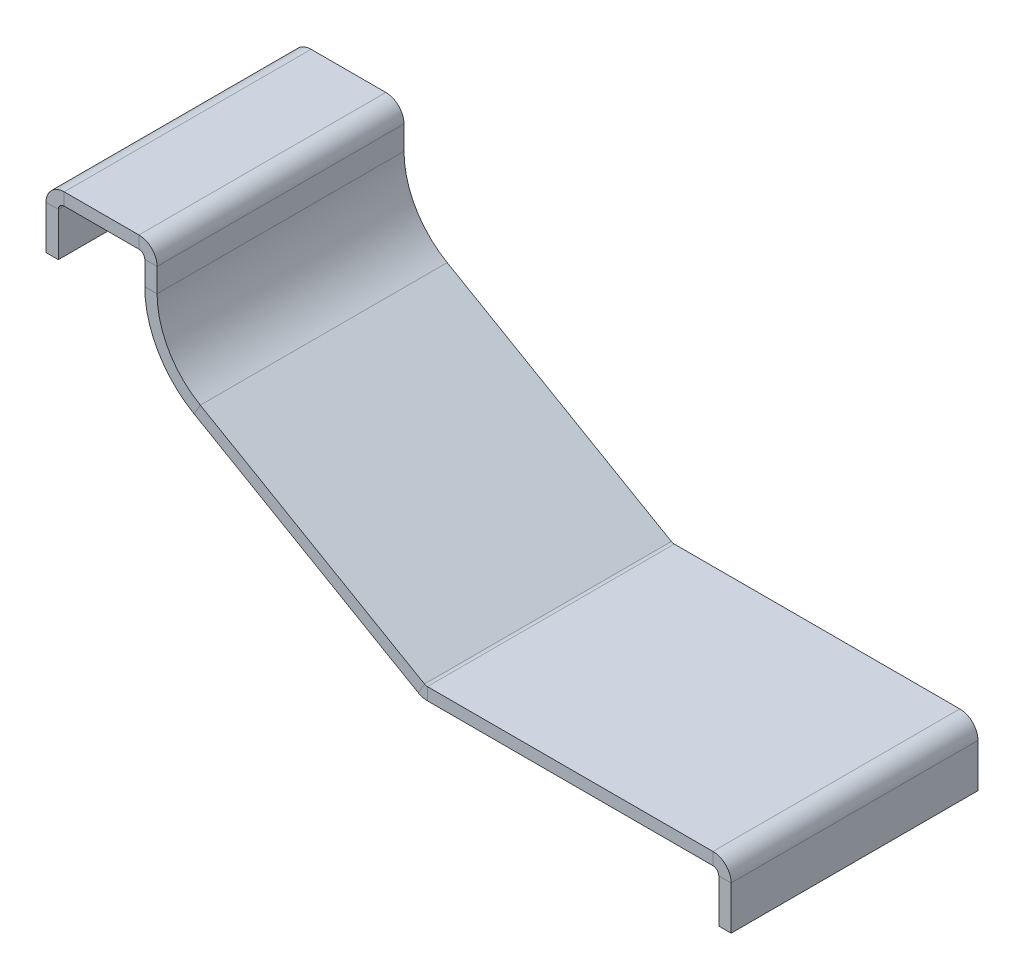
ISO-10303-21;
HEADER;
FILE_DESCRIPTION(('STEP AP214'),'2;1');
FILE_NAME('part.step','',(''),(''),'','','');
FILE_SCHEMA(('AUTOMOTIVE_DESIGN { 1 0 10303 214 1 1 1 1 }'));
ENDSEC;
DATA;
#1=APPLICATION_CONTEXT('core data for automotive mechanical design processes');
#2=APPLICATION_PROTOCOL_DEFINITION('international standard','automotive_design',2000,#1);
#3=PRODUCT_CONTEXT('',#1,'mechanical');
#4=PRODUCT('Part','Part','',(#3));
#5=PRODUCT_RELATED_PRODUCT_CATEGORY('part','',(#4));
#6=PRODUCT_DEFINITION_FORMATION('','',#4);
#7=PRODUCT_DEFINITION_CONTEXT('part definition',#1,'design');
#8=PRODUCT_DEFINITION('design','',#6,#7);
#9=PRODUCT_DEFINITION_SHAPE('','',#8);
#10=(LENGTH_UNIT() NAMED_UNIT(*) SI_UNIT(.MILLI.,.METRE.));
#11=(NAMED_UNIT(*) PLANE_ANGLE_UNIT() SI_UNIT($,.RADIAN.));
#12=(NAMED_UNIT(*) SI_UNIT($,.STERADIAN.) SOLID_ANGLE_UNIT());
#13=UNCERTAINTY_MEASURE_WITH_UNIT(LENGTH_MEASURE(1.E-05),#10,'distance_accuracy_value','');
#14=(GEOMETRIC_REPRESENTATION_CONTEXT(3) GLOBAL_UNCERTAINTY_ASSIGNED_CONTEXT((#13)) GLOBAL_UNIT_ASSIGNED_CONTEXT((#10,
#11,#12)) REPRESENTATION_CONTEXT('',''));
#15=CARTESIAN_POINT('',(0.,0.,0.));
#16=DIRECTION('',(0.,0.,1.));
#17=DIRECTION('',(1.,0.,0.));
#18=AXIS2_PLACEMENT_3D('',#15,#16,#17);
#19=CARTESIAN_POINT('',(6.44142254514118,-12.,5.));
#20=DIRECTION('',(0.,-1.,0.));
#21=DIRECTION('',(1.,0.,0.));
#22=AXIS2_PLACEMENT_3D('',#19,#20,#21);
#23=PLANE('',#22);
#24=DIRECTION('',(1.,0.,0.));
#25=VECTOR('',#24,1.);
#26=CARTESIAN_POINT('',(6.44142254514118,-12.,-5.));
#27=LINE('',#26,#25);
#28=CARTESIAN_POINT('',(26.75,-12.,-5.));
#29=VERTEX_POINT('',#28);
#30=CARTESIAN_POINT('',(27.25,-12.,-5.));
#31=VERTEX_POINT('',#30);
#32=EDGE_CURVE('E250',#29,#31,#27,.T.);
#33=ORIENTED_EDGE('',*,*,#32,.T.);
#34=DIRECTION('',(0.,0.,-1.));
#35=VECTOR('',#34,1.);
#36=CARTESIAN_POINT('',(27.25,-12.,5.));
#37=LINE('',#36,#35);
#38=CARTESIAN_POINT('',(27.25,-12.,5.));
#39=VERTEX_POINT('',#38);
#40=EDGE_CURVE('E241',#39,#31,#37,.T.);
#41=ORIENTED_EDGE('',*,*,#40,.F.);
#42=DIRECTION('',(1.,0.,0.));
#43=VECTOR('',#42,1.);
#44=CARTESIAN_POINT('',(6.44142254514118,-12.,5.));
#45=LINE('',#44,#43);
#46=CARTESIAN_POINT('',(26.75,-12.,5.));
#47=VERTEX_POINT('',#46);
#48=EDGE_CURVE('E239',#47,#39,#45,.T.);
#49=ORIENTED_EDGE('',*,*,#48,.F.);
#50=DIRECTION('',(0.,0.,-1.));
#51=VECTOR('',#50,1.);
#52=CARTESIAN_POINT('',(26.75,-12.,5.));
#53=LINE('',#52,#51);
#54=EDGE_CURVE('E248',#47,#29,#53,.T.);
#55=ORIENTED_EDGE('',*,*,#54,.T.);
#56=EDGE_LOOP('',(#33,#41,#49,#55));
#57=FACE_BOUND('',#56,.T.);
#58=ADVANCED_FACE('F17',(#57),#23,.T.);
#59=CARTESIAN_POINT('',(6.44142254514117,-10.,-5.));
#60=DIRECTION('',(0.,0.,1.));
#61=DIRECTION('',(0.,-1.,0.));
#62=AXIS2_PLACEMENT_3D('',#59,#60,#61);
#63=PLANE('',#62);
#64=DIRECTION('',(0.,1.,0.));
#65=VECTOR('',#64,1.);
#66=CARTESIAN_POINT('',(27.25,-10.,-5.));
#67=LINE('',#66,#65);
#68=CARTESIAN_POINT('',(27.25,-10.2366,-5.));
#69=VERTEX_POINT('',#68);
#70=EDGE_CURVE('E245',#69,#31,#67,.F.);
#71=ORIENTED_EDGE('',*,*,#70,.T.);
#72=ORIENTED_EDGE('',*,*,#32,.F.);
#73=DIRECTION('',(0.,-1.,0.));
#74=VECTOR('',#73,1.);
#75=CARTESIAN_POINT('',(26.75,-10.,-5.));
#76=LINE('',#75,#74);
#77=CARTESIAN_POINT('',(26.75,-10.2366,-5.));
#78=VERTEX_POINT('',#77);
#79=EDGE_CURVE('E11',#78,#29,#76,.T.);
#80=ORIENTED_EDGE('',*,*,#79,.F.);
#81=DIRECTION('',(1.,0.,0.));
#82=VECTOR('',#81,1.);
#83=CARTESIAN_POINT('',(6.44142254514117,-10.2366,-5.));
#84=LINE('',#83,#82);
#85=EDGE_CURVE('E243',#78,#69,#84,.T.);
#86=ORIENTED_EDGE('',*,*,#85,.T.);
#87=EDGE_LOOP('',(#71,#72,#80,#86));
#88=FACE_BOUND('',#87,.T.);
#89=ADVANCED_FACE('F534',(#88),#63,.F.);
#90=CARTESIAN_POINT('',(27.25,-10.,5.));
#91=DIRECTION('',(1.,0.,0.));
#92=DIRECTION('',(0.,0.,-1.));
#93=AXIS2_PLACEMENT_3D('',#90,#91,#92);
#94=PLANE('',#93);
#95=DIRECTION('',(0.,0.,-1.));
#96=VECTOR('',#95,1.);
#97=CARTESIAN_POINT('',(27.25,-10.2366,-5.));
#98=LINE('',#97,#96);
#99=CARTESIAN_POINT('',(27.25,-10.2366,5.));
#100=VERTEX_POINT('',#99);
#101=EDGE_CURVE('E252',#100,#69,#98,.T.);
#102=ORIENTED_EDGE('',*,*,#101,.F.);
#103=DIRECTION('',(0.,1.,0.));
#104=VECTOR('',#103,1.);
#105=CARTESIAN_POINT('',(27.25,-10.,5.));
#106=LINE('',#105,#104);
#107=EDGE_CURVE('E237',#39,#100,#106,.T.);
#108=ORIENTED_EDGE('',*,*,#107,.F.);
#109=ORIENTED_EDGE('',*,*,#40,.T.);
#110=ORIENTED_EDGE('',*,*,#70,.F.);
#111=EDGE_LOOP('',(#102,#108,#109,#110));
#112=FACE_BOUND('',#111,.T.);
#113=ADVANCED_FACE('F540',(#112),#94,.T.);
#114=CARTESIAN_POINT('',(6.44142254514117,-10.,5.));
#115=DIRECTION('',(0.,0.,1.));
#116=DIRECTION('',(0.,-1.,0.));
#117=AXIS2_PLACEMENT_3D('',#114,#115,#116);
#118=PLANE('',#117);
#119=ORIENTED_EDGE('',*,*,#48,.T.);
#120=ORIENTED_EDGE('',*,*,#107,.T.);
#121=DIRECTION('',(1.,0.,0.));
#122=VECTOR('',#121,1.);
#123=CARTESIAN_POINT('',(6.44142254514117,-10.2366,5.));
#124=LINE('',#123,#122);
#125=CARTESIAN_POINT('',(26.75,-10.2366,5.));
#126=VERTEX_POINT('',#125);
#127=EDGE_CURVE('E21',#126,#100,#124,.T.);
#128=ORIENTED_EDGE('',*,*,#127,.F.);
#129=DIRECTION('',(0.,1.,0.));
#130=VECTOR('',#129,1.);
#131=CARTESIAN_POINT('',(26.75,-10.,5.));
#132=LINE('',#131,#130);
#133=EDGE_CURVE('E36',#47,#126,#132,.T.);
#134=ORIENTED_EDGE('',*,*,#133,.F.);
#135=EDGE_LOOP('',(#119,#120,#128,#134));
#136=FACE_BOUND('',#135,.T.);
#137=ADVANCED_FACE('F546',(#136),#118,.T.);
#138=CARTESIAN_POINT('',(26.75,-10.,5.));
#139=DIRECTION('',(1.,0.,0.));
#140=DIRECTION('',(0.,0.,-1.));
#141=AXIS2_PLACEMENT_3D('',#138,#139,#140);
#142=PLANE('',#141);
#143=ORIENTED_EDGE('',*,*,#133,.T.);
#144=DIRECTION('',(0.,0.,-1.));
#145=VECTOR('',#144,1.);
#146=CARTESIAN_POINT('',(26.75,-10.2366,-5.));
#147=LINE('',#146,#145);
#148=EDGE_CURVE('E27',#126,#78,#147,.T.);
#149=ORIENTED_EDGE('',*,*,#148,.T.);
#150=ORIENTED_EDGE('',*,*,#79,.T.);
#151=ORIENTED_EDGE('',*,*,#54,.F.);
#152=EDGE_LOOP('',(#143,#149,#150,#151));
#153=FACE_BOUND('',#152,.T.);
#154=ADVANCED_FACE('F19',(#153),#142,.F.);
#155=CARTESIAN_POINT('',(14.75,20.5792752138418,5.));
#156=DIRECTION('',(0.,0.,-1.));
#157=DIRECTION('',(-1.,0.,0.));
#158=AXIS2_PLACEMENT_3D('',#155,#156,#157);
#159=PLANE('',#158);
#160=DIRECTION('',(0.,-1.,0.));
#161=VECTOR('',#160,1.);
#162=CARTESIAN_POINT('',(14.9473713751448,20.5792752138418,5.));
#163=LINE('',#162,#161);
#164=CARTESIAN_POINT('',(14.9473713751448,-9.5,5.));
#165=VERTEX_POINT('',#164);
#166=CARTESIAN_POINT('',(14.9473713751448,-10.,5.));
#167=VERTEX_POINT('',#166);
#168=EDGE_CURVE('E198',#165,#167,#163,.T.);
#169=ORIENTED_EDGE('',*,*,#168,.T.);
#170=DIRECTION('',(1.,0.,0.));
#171=VECTOR('',#170,1.);
#172=CARTESIAN_POINT('',(14.75,-10.,5.));
#173=LINE('',#172,#171);
#174=CARTESIAN_POINT('',(26.5134,-10.,5.));
#175=VERTEX_POINT('',#174);
#176=EDGE_CURVE('E212',#167,#175,#173,.T.);
#177=ORIENTED_EDGE('',*,*,#176,.T.);
#178=DIRECTION('',(0.,-1.,0.));
#179=VECTOR('',#178,1.);
#180=CARTESIAN_POINT('',(26.5134,20.5792752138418,5.));
#181=LINE('',#180,#179);
#182=CARTESIAN_POINT('',(26.5134,-9.5,5.));
#183=VERTEX_POINT('',#182);
#184=EDGE_CURVE('E187',#183,#175,#181,.T.);
#185=ORIENTED_EDGE('',*,*,#184,.F.);
#186=DIRECTION('',(1.,0.,0.));
#187=VECTOR('',#186,1.);
#188=CARTESIAN_POINT('',(14.75,-9.5,5.));
#189=LINE('',#188,#187);
#190=EDGE_CURVE('E256',#165,#183,#189,.T.);
#191=ORIENTED_EDGE('',*,*,#190,.F.);
#192=EDGE_LOOP('',(#169,#177,#185,#191));
#193=FACE_BOUND('',#192,.T.);
#194=ADVANCED_FACE('F213',(#193),#159,.F.);
#195=CARTESIAN_POINT('',(14.75,-10.,5.));
#196=DIRECTION('',(0.,1.,0.));
#197=DIRECTION('',(0.,0.,1.));
#198=AXIS2_PLACEMENT_3D('',#195,#196,#197);
#199=PLANE('',#198);
#200=DIRECTION('',(1.,0.,0.));
#201=VECTOR('',#200,1.);
#202=CARTESIAN_POINT('',(14.75,-10.,-5.));
#203=LINE('',#202,#201);
#204=CARTESIAN_POINT('',(14.9473713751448,-10.,-5.));
#205=VERTEX_POINT('',#204);
#206=CARTESIAN_POINT('',(26.5134,-10.,-5.));
#207=VERTEX_POINT('',#206);
#208=EDGE_CURVE('E216',#205,#207,#203,.T.);
#209=ORIENTED_EDGE('',*,*,#208,.T.);
#210=DIRECTION('',(0.,0.,1.));
#211=VECTOR('',#210,1.);
#212=CARTESIAN_POINT('',(26.5134,-10.,-5.));
#213=LINE('',#212,#211);
#214=EDGE_CURVE('E206',#207,#175,#213,.T.);
#215=ORIENTED_EDGE('',*,*,#214,.T.);
#216=ORIENTED_EDGE('',*,*,#176,.F.);
#217=DIRECTION('',(0.,0.,-1.));
#218=VECTOR('',#217,1.);
#219=CARTESIAN_POINT('',(14.9473713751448,-10.,5.));
#220=LINE('',#219,#218);
#221=EDGE_CURVE('E221',#167,#205,#220,.T.);
#222=ORIENTED_EDGE('',*,*,#221,.T.);
#223=EDGE_LOOP('',(#209,#215,#216,#222));
#224=FACE_BOUND('',#223,.T.);
#225=ADVANCED_FACE('F218',(#224),#199,.F.);
#226=CARTESIAN_POINT('',(14.75,20.5792752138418,-5.));
#227=DIRECTION('',(0.,0.,-1.));
#228=DIRECTION('',(-1.,0.,0.));
#229=AXIS2_PLACEMENT_3D('',#226,#227,#228);
#230=PLANE('',#229);
#231=ORIENTED_EDGE('',*,*,#208,.F.);
#232=DIRECTION('',(0.,-1.,0.));
#233=VECTOR('',#232,1.);
#234=CARTESIAN_POINT('',(14.9473713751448,20.5792752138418,-5.));
#235=LINE('',#234,#233);
#236=CARTESIAN_POINT('',(14.9473713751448,-9.5,-5.));
#237=VERTEX_POINT('',#236);
#238=EDGE_CURVE('E230',#237,#205,#235,.T.);
#239=ORIENTED_EDGE('',*,*,#238,.F.);
#240=DIRECTION('',(1.,0.,0.));
#241=VECTOR('',#240,1.);
#242=CARTESIAN_POINT('',(14.75,-9.5,-5.));
#243=LINE('',#242,#241);
#244=CARTESIAN_POINT('',(26.5134,-9.5,-5.));
#245=VERTEX_POINT('',#244);
#246=EDGE_CURVE('E223',#237,#245,#243,.T.);
#247=ORIENTED_EDGE('',*,*,#246,.T.);
#248=DIRECTION('',(0.,-1.,0.));
#249=VECTOR('',#248,1.);
#250=CARTESIAN_POINT('',(26.5134,20.5792752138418,-5.));
#251=LINE('',#250,#249);
#252=EDGE_CURVE('E257',#245,#207,#251,.T.);
#253=ORIENTED_EDGE('',*,*,#252,.T.);
#254=EDGE_LOOP('',(#231,#239,#247,#253));
#255=FACE_BOUND('',#254,.T.);
#256=ADVANCED_FACE('F270',(#255),#230,.T.);
#257=CARTESIAN_POINT('',(14.75,-9.5,5.));
#258=DIRECTION('',(0.,1.,0.));
#259=DIRECTION('',(0.,0.,1.));
#260=AXIS2_PLACEMENT_3D('',#257,#258,#259);
#261=PLANE('',#260);
#262=DIRECTION('',(0.,0.,1.));
#263=VECTOR('',#262,1.);
#264=CARTESIAN_POINT('',(26.5134,-9.5,-5.));
#265=LINE('',#264,#263);
#266=EDGE_CURVE('E199',#245,#183,#265,.T.);
#267=ORIENTED_EDGE('',*,*,#266,.F.);
#268=ORIENTED_EDGE('',*,*,#246,.F.);
#269=DIRECTION('',(0.,0.,-1.));
#270=VECTOR('',#269,1.);
#271=CARTESIAN_POINT('',(14.9473713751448,-9.5,5.));
#272=LINE('',#271,#270);
#273=EDGE_CURVE('E232',#165,#237,#272,.T.);
#274=ORIENTED_EDGE('',*,*,#273,.F.);
#275=ORIENTED_EDGE('',*,*,#190,.T.);
#276=EDGE_LOOP('',(#267,#268,#274,#275));
#277=FACE_BOUND('',#276,.T.);
#278=ADVANCED_FACE('F271',(#277),#261,.T.);
#279=CARTESIAN_POINT('',(19.9881347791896,20.4346755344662,5.));
#280=DIRECTION('',(0.,0.,-1.));
#281=DIRECTION('',(-0.866025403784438,0.5,0.));
#282=AXIS2_PLACEMENT_3D('',#279,#280,#281);
#283=PLANE('',#282);
#284=DIRECTION('',(-0.5,-0.866025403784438,0.));
#285=VECTOR('',#284,1.);
#286=CARTESIAN_POINT('',(19.9881347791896,20.4346755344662,5.));
#287=LINE('',#286,#285);
#288=CARTESIAN_POINT('',(5.75,-4.22649730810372,5.));
#289=VERTEX_POINT('',#288);
#290=CARTESIAN_POINT('',(5.5,-4.65951000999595,5.));
#291=VERTEX_POINT('',#290);
#292=EDGE_CURVE('E440',#289,#291,#287,.T.);
#293=ORIENTED_EDGE('',*,*,#292,.T.);
#294=DIRECTION('',(0.866025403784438,-0.5,0.));
#295=VECTOR('',#294,1.);
#296=CARTESIAN_POINT('',(5.5,-4.65951000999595,5.));
#297=LINE('',#296,#295);
#298=CARTESIAN_POINT('',(14.5790713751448,-9.90131431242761,5.));
#299=VERTEX_POINT('',#298);
#300=EDGE_CURVE('E437',#291,#299,#297,.T.);
#301=ORIENTED_EDGE('',*,*,#300,.T.);
#302=DIRECTION('',(-0.5,-0.866025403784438,0.));
#303=VECTOR('',#302,1.);
#304=CARTESIAN_POINT('',(29.0672061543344,15.1928712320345,5.));
#305=LINE('',#304,#303);
#306=CARTESIAN_POINT('',(14.8290713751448,-9.46830161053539,5.));
#307=VERTEX_POINT('',#306);
#308=EDGE_CURVE('E443',#307,#299,#305,.T.);
#309=ORIENTED_EDGE('',*,*,#308,.F.);
#310=DIRECTION('',(0.866025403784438,-0.5,0.));
#311=VECTOR('',#310,1.);
#312=CARTESIAN_POINT('',(5.75,-4.22649730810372,5.));
#313=LINE('',#312,#311);
#314=EDGE_CURVE('E422',#289,#307,#313,.T.);
#315=ORIENTED_EDGE('',*,*,#314,.F.);
#316=EDGE_LOOP('',(#293,#301,#309,#315));
#317=FACE_BOUND('',#316,.T.);
#318=ADVANCED_FACE('F474',(#317),#283,.F.);
#319=CARTESIAN_POINT('',(5.5,-4.65951000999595,5.));
#320=DIRECTION('',(0.5,0.866025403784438,0.));
#321=DIRECTION('',(-0.866025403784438,0.5,0.));
#322=AXIS2_PLACEMENT_3D('',#319,#320,#321);
#323=PLANE('',#322);
#324=DIRECTION('',(0.,0.,-1.));
#325=VECTOR('',#324,1.);
#326=CARTESIAN_POINT('',(14.5790713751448,-9.90131431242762,5.));
#327=LINE('',#326,#325);
#328=CARTESIAN_POINT('',(14.5790713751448,-9.90131431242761,-5.));
#329=VERTEX_POINT('',#328);
#330=EDGE_CURVE('E445',#299,#329,#327,.T.);
#331=ORIENTED_EDGE('',*,*,#330,.F.);
#332=ORIENTED_EDGE('',*,*,#300,.F.);
#333=DIRECTION('',(0.,0.,-1.));
#334=VECTOR('',#333,1.);
#335=CARTESIAN_POINT('',(5.5,-4.65951000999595,5.));
#336=LINE('',#335,#334);
#337=CARTESIAN_POINT('',(5.5,-4.65951000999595,-5.));
#338=VERTEX_POINT('',#337);
#339=EDGE_CURVE('E434',#291,#338,#336,.T.);
#340=ORIENTED_EDGE('',*,*,#339,.T.);
#341=DIRECTION('',(0.866025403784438,-0.5,0.));
#342=VECTOR('',#341,1.);
#343=CARTESIAN_POINT('',(5.5,-4.65951000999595,-5.));
#344=LINE('',#343,#342);
#345=EDGE_CURVE('E431',#338,#329,#344,.T.);
#346=ORIENTED_EDGE('',*,*,#345,.T.);
#347=EDGE_LOOP('',(#331,#332,#340,#346));
#348=FACE_BOUND('',#347,.T.);
#349=ADVANCED_FACE('F466',(#348),#323,.F.);
#350=CARTESIAN_POINT('',(19.9881347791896,20.4346755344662,-5.));
#351=DIRECTION('',(0.,0.,-1.));
#352=DIRECTION('',(-0.866025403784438,0.5,0.));
#353=AXIS2_PLACEMENT_3D('',#350,#351,#352);
#354=PLANE('',#353);
#355=ORIENTED_EDGE('',*,*,#345,.F.);
#356=DIRECTION('',(-0.5,-0.866025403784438,0.));
#357=VECTOR('',#356,1.);
#358=CARTESIAN_POINT('',(19.9881347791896,20.4346755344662,-5.));
#359=LINE('',#358,#357);
#360=CARTESIAN_POINT('',(5.75,-4.22649730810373,-5.));
#361=VERTEX_POINT('',#360);
#362=EDGE_CURVE('E446',#361,#338,#359,.T.);
#363=ORIENTED_EDGE('',*,*,#362,.F.);
#364=DIRECTION('',(0.866025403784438,-0.5,0.));
#365=VECTOR('',#364,1.);
#366=CARTESIAN_POINT('',(5.75,-4.22649730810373,-5.));
#367=LINE('',#366,#365);
#368=CARTESIAN_POINT('',(14.8290713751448,-9.4683016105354,-5.));
#369=VERTEX_POINT('',#368);
#370=EDGE_CURVE('E428',#361,#369,#367,.T.);
#371=ORIENTED_EDGE('',*,*,#370,.T.);
#372=DIRECTION('',(-0.5,-0.866025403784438,0.));
#373=VECTOR('',#372,1.);
#374=CARTESIAN_POINT('',(29.0672061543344,15.1928712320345,-5.));
#375=LINE('',#374,#373);
#376=EDGE_CURVE('E425',#369,#329,#375,.T.);
#377=ORIENTED_EDGE('',*,*,#376,.T.);
#378=EDGE_LOOP('',(#355,#363,#371,#377));
#379=FACE_BOUND('',#378,.T.);
#380=ADVANCED_FACE('F462',(#379),#354,.T.);
#381=CARTESIAN_POINT('',(5.75,-4.22649730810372,5.));
#382=DIRECTION('',(0.5,0.866025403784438,0.));
#383=DIRECTION('',(-0.866025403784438,0.5,0.));
#384=AXIS2_PLACEMENT_3D('',#381,#382,#383);
#385=PLANE('',#384);
#386=ORIENTED_EDGE('',*,*,#314,.T.);
#387=DIRECTION('',(0.,0.,-1.));
#388=VECTOR('',#387,1.);
#389=CARTESIAN_POINT('',(14.8290713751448,-9.4683016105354,5.));
#390=LINE('',#389,#388);
#391=EDGE_CURVE('E233',#307,#369,#390,.T.);
#392=ORIENTED_EDGE('',*,*,#391,.T.);
#393=ORIENTED_EDGE('',*,*,#370,.F.);
#394=DIRECTION('',(0.,0.,-1.));
#395=VECTOR('',#394,1.);
#396=CARTESIAN_POINT('',(5.75,-4.22649730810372,5.));
#397=LINE('',#396,#395);
#398=EDGE_CURVE('E264',#289,#361,#397,.T.);
#399=ORIENTED_EDGE('',*,*,#398,.F.);
#400=EDGE_LOOP('',(#386,#392,#393,#399));
#401=FACE_BOUND('',#400,.T.);
#402=ADVANCED_FACE('F458',(#401),#385,.T.);
#403=CARTESIAN_POINT('',(-16.5917210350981,-1.19540839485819,-5.));
#404=DIRECTION('',(0.,0.,1.));
#405=DIRECTION('',(0.,-1.,0.));
#406=AXIS2_PLACEMENT_3D('',#403,#404,#405);
#407=PLANE('',#406);
#408=DIRECTION('',(0.,1.,0.));
#409=VECTOR('',#408,1.);
#410=CARTESIAN_POINT('',(4.,-1.19540839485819,-5.));
#411=LINE('',#410,#409);
#412=CARTESIAN_POINT('',(4.,-0.2366,-5.));
#413=VERTEX_POINT('',#412);
#414=CARTESIAN_POINT('',(4.,-1.19540839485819,-5.));
#415=VERTEX_POINT('',#414);
#416=EDGE_CURVE('E316',#413,#415,#411,.F.);
#417=ORIENTED_EDGE('',*,*,#416,.T.);
#418=DIRECTION('',(1.,0.,0.));
#419=VECTOR('',#418,1.);
#420=CARTESIAN_POINT('',(-16.5917210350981,-1.19540839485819,-5.));
#421=LINE('',#420,#419);
#422=CARTESIAN_POINT('',(3.5,-1.19540839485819,-5.));
#423=VERTEX_POINT('',#422);
#424=EDGE_CURVE('E410',#423,#415,#421,.T.);
#425=ORIENTED_EDGE('',*,*,#424,.F.);
#426=DIRECTION('',(0.,-1.,0.));
#427=VECTOR('',#426,1.);
#428=CARTESIAN_POINT('',(3.5,-1.19540839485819,-5.));
#429=LINE('',#428,#427);
#430=CARTESIAN_POINT('',(3.5,-0.2366,-5.));
#431=VERTEX_POINT('',#430);
#432=EDGE_CURVE('E396',#431,#423,#429,.T.);
#433=ORIENTED_EDGE('',*,*,#432,.F.);
#434=DIRECTION('',(1.,0.,0.));
#435=VECTOR('',#434,1.);
#436=CARTESIAN_POINT('',(-16.5917210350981,-0.2366,-5.));
#437=LINE('',#436,#435);
#438=EDGE_CURVE('E412',#431,#413,#437,.T.);
#439=ORIENTED_EDGE('',*,*,#438,.T.);
#440=EDGE_LOOP('',(#417,#425,#433,#439));
#441=FACE_BOUND('',#440,.T.);
#442=ADVANCED_FACE('F488',(#441),#407,.F.);
#443=CARTESIAN_POINT('',(-16.5917210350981,-1.19540839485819,5.));
#444=DIRECTION('',(0.,0.,1.));
#445=DIRECTION('',(0.,-1.,0.));
#446=AXIS2_PLACEMENT_3D('',#443,#444,#445);
#447=PLANE('',#446);
#448=DIRECTION('',(1.,0.,0.));
#449=VECTOR('',#448,1.);
#450=CARTESIAN_POINT('',(-16.5917210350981,-1.19540839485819,5.));
#451=LINE('',#450,#449);
#452=CARTESIAN_POINT('',(3.5,-1.19540839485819,5.));
#453=VERTEX_POINT('',#452);
#454=CARTESIAN_POINT('',(4.,-1.19540839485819,5.));
#455=VERTEX_POINT('',#454);
#456=EDGE_CURVE('E407',#453,#455,#451,.T.);
#457=ORIENTED_EDGE('',*,*,#456,.T.);
#458=DIRECTION('',(0.,1.,0.));
#459=VECTOR('',#458,1.);
#460=CARTESIAN_POINT('',(4.,-1.19540839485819,5.));
#461=LINE('',#460,#459);
#462=CARTESIAN_POINT('',(4.,-0.2366,5.));
#463=VERTEX_POINT('',#462);
#464=EDGE_CURVE('E417',#455,#463,#461,.T.);
#465=ORIENTED_EDGE('',*,*,#464,.T.);
#466=DIRECTION('',(1.,0.,0.));
#467=VECTOR('',#466,1.);
#468=CARTESIAN_POINT('',(-16.5917210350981,-0.2366,5.));
#469=LINE('',#468,#467);
#470=CARTESIAN_POINT('',(3.5,-0.2366,5.));
#471=VERTEX_POINT('',#470);
#472=EDGE_CURVE('E404',#471,#463,#469,.T.);
#473=ORIENTED_EDGE('',*,*,#472,.F.);
#474=DIRECTION('',(0.,1.,0.));
#475=VECTOR('',#474,1.);
#476=CARTESIAN_POINT('',(3.5,-1.19540839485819,5.));
#477=LINE('',#476,#475);
#478=EDGE_CURVE('E414',#453,#471,#477,.T.);
#479=ORIENTED_EDGE('',*,*,#478,.F.);
#480=EDGE_LOOP('',(#457,#465,#473,#479));
#481=FACE_BOUND('',#480,.T.);
#482=ADVANCED_FACE('F479',(#481),#447,.T.);
#483=CARTESIAN_POINT('',(3.5,-1.19540839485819,5.));
#484=DIRECTION('',(1.,0.,0.));
#485=DIRECTION('',(0.,0.,-1.));
#486=AXIS2_PLACEMENT_3D('',#483,#484,#485);
#487=PLANE('',#486);
#488=ORIENTED_EDGE('',*,*,#478,.T.);
#489=DIRECTION('',(0.,0.,-1.));
#490=VECTOR('',#489,1.);
#491=CARTESIAN_POINT('',(3.5,-0.2366,-5.));
#492=LINE('',#491,#490);
#493=EDGE_CURVE('E401',#471,#431,#492,.T.);
#494=ORIENTED_EDGE('',*,*,#493,.T.);
#495=ORIENTED_EDGE('',*,*,#432,.T.);
#496=DIRECTION('',(0.,0.,-1.));
#497=VECTOR('',#496,1.);
#498=CARTESIAN_POINT('',(3.5,-1.19540839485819,5.));
#499=LINE('',#498,#497);
#500=EDGE_CURVE('E399',#453,#423,#499,.T.);
#501=ORIENTED_EDGE('',*,*,#500,.F.);
#502=EDGE_LOOP('',(#488,#494,#495,#501));
#503=FACE_BOUND('',#502,.T.);
#504=ADVANCED_FACE('F484',(#503),#487,.F.);
#505=CARTESIAN_POINT('',(4.,-1.19540839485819,5.));
#506=DIRECTION('',(1.,0.,0.));
#507=DIRECTION('',(0.,0.,-1.));
#508=AXIS2_PLACEMENT_3D('',#505,#506,#507);
#509=PLANE('',#508);
#510=DIRECTION('',(0.,0.,-1.));
#511=VECTOR('',#510,1.);
#512=CARTESIAN_POINT('',(4.,-0.2366,-5.));
#513=LINE('',#512,#511);
#514=EDGE_CURVE('E393',#463,#413,#513,.T.);
#515=ORIENTED_EDGE('',*,*,#514,.F.);
#516=ORIENTED_EDGE('',*,*,#464,.F.);
#517=DIRECTION('',(0.,0.,-1.));
#518=VECTOR('',#517,1.);
#519=CARTESIAN_POINT('',(4.,-1.19540839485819,5.));
#520=LINE('',#519,#518);
#521=EDGE_CURVE('E390',#455,#415,#520,.T.);
#522=ORIENTED_EDGE('',*,*,#521,.T.);
#523=ORIENTED_EDGE('',*,*,#416,.F.);
#524=EDGE_LOOP('',(#515,#516,#522,#523));
#525=FACE_BOUND('',#524,.T.);
#526=ADVANCED_FACE('F492',(#525),#509,.T.);
#527=CARTESIAN_POINT('',(20.3085774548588,-2.,5.));
#528=DIRECTION('',(0.,1.,0.));
#529=DIRECTION('',(-1.,0.,0.));
#530=AXIS2_PLACEMENT_3D('',#527,#528,#529);
#531=PLANE('',#530);
#532=DIRECTION('',(0.,0.,-1.));
#533=VECTOR('',#532,1.);
#534=CARTESIAN_POINT('',(-0.5,-2.,5.));
#535=LINE('',#534,#533);
#536=CARTESIAN_POINT('',(-0.5,-2.,5.));
#537=VERTEX_POINT('',#536);
#538=CARTESIAN_POINT('',(-0.5,-2.,-5.));
#539=VERTEX_POINT('',#538);
#540=EDGE_CURVE('E381',#537,#539,#535,.T.);
#541=ORIENTED_EDGE('',*,*,#540,.T.);
#542=DIRECTION('',(-1.,0.,0.));
#543=VECTOR('',#542,1.);
#544=CARTESIAN_POINT('',(20.3085774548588,-2.,-5.));
#545=LINE('',#544,#543);
#546=CARTESIAN_POINT('',(0.,-2.,-5.));
#547=VERTEX_POINT('',#546);
#548=EDGE_CURVE('E374',#547,#539,#545,.T.);
#549=ORIENTED_EDGE('',*,*,#548,.F.);
#550=DIRECTION('',(0.,0.,-1.));
#551=VECTOR('',#550,1.);
#552=CARTESIAN_POINT('',(0.,-2.,5.));
#553=LINE('',#552,#551);
#554=CARTESIAN_POINT('',(0.,-2.,5.));
#555=VERTEX_POINT('',#554);
#556=EDGE_CURVE('E360',#555,#547,#553,.T.);
#557=ORIENTED_EDGE('',*,*,#556,.F.);
#558=DIRECTION('',(-1.,0.,0.));
#559=VECTOR('',#558,1.);
#560=CARTESIAN_POINT('',(20.3085774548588,-2.,5.));
#561=LINE('',#560,#559);
#562=EDGE_CURVE('E378',#555,#537,#561,.T.);
#563=ORIENTED_EDGE('',*,*,#562,.T.);
#564=EDGE_LOOP('',(#541,#549,#557,#563));
#565=FACE_BOUND('',#564,.T.);
#566=ADVANCED_FACE('F748',(#565),#531,.F.);
#567=CARTESIAN_POINT('',(20.3085774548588,0.,-5.));
#568=DIRECTION('',(0.,0.,1.));
#569=DIRECTION('',(0.,1.,0.));
#570=AXIS2_PLACEMENT_3D('',#567,#568,#569);
#571=PLANE('',#570);
#572=DIRECTION('',(0.,1.,0.));
#573=VECTOR('',#572,1.);
#574=CARTESIAN_POINT('',(-0.5,0.,-5.));
#575=LINE('',#574,#573);
#576=CARTESIAN_POINT('',(-0.5,-0.2366,-5.));
#577=VERTEX_POINT('',#576);
#578=EDGE_CURVE('E376',#539,#577,#575,.T.);
#579=ORIENTED_EDGE('',*,*,#578,.T.);
#580=DIRECTION('',(-1.,0.,0.));
#581=VECTOR('',#580,1.);
#582=CARTESIAN_POINT('',(20.3085774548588,-0.236599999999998,-5.));
#583=LINE('',#582,#581);
#584=CARTESIAN_POINT('',(0.,-0.2366,-5.));
#585=VERTEX_POINT('',#584);
#586=EDGE_CURVE('E354',#585,#577,#583,.T.);
#587=ORIENTED_EDGE('',*,*,#586,.F.);
#588=DIRECTION('',(0.,1.,0.));
#589=VECTOR('',#588,1.);
#590=CARTESIAN_POINT('',(0.,0.,-5.));
#591=LINE('',#590,#589);
#592=EDGE_CURVE('E364',#547,#585,#591,.T.);
#593=ORIENTED_EDGE('',*,*,#592,.F.);
#594=ORIENTED_EDGE('',*,*,#548,.T.);
#595=EDGE_LOOP('',(#579,#587,#593,#594));
#596=FACE_BOUND('',#595,.T.);
#597=ADVANCED_FACE('F740',(#596),#571,.F.);
#598=CARTESIAN_POINT('',(-0.5,0.,5.));
#599=DIRECTION('',(-1.,0.,0.));
#600=DIRECTION('',(0.,-1.,0.));
#601=AXIS2_PLACEMENT_3D('',#598,#599,#600);
#602=PLANE('',#601);
#603=DIRECTION('',(0.,0.,1.));
#604=VECTOR('',#603,1.);
#605=CARTESIAN_POINT('',(-0.5,-0.2366,5.));
#606=LINE('',#605,#604);
#607=CARTESIAN_POINT('',(-0.5,-0.2366,5.));
#608=VERTEX_POINT('',#607);
#609=EDGE_CURVE('E348',#577,#608,#606,.T.);
#610=ORIENTED_EDGE('',*,*,#609,.F.);
#611=ORIENTED_EDGE('',*,*,#578,.F.);
#612=ORIENTED_EDGE('',*,*,#540,.F.);
#613=DIRECTION('',(0.,1.,0.));
#614=VECTOR('',#613,1.);
#615=CARTESIAN_POINT('',(-0.5,0.,5.));
#616=LINE('',#615,#614);
#617=EDGE_CURVE('E372',#537,#608,#616,.T.);
#618=ORIENTED_EDGE('',*,*,#617,.T.);
#619=EDGE_LOOP('',(#610,#611,#612,#618));
#620=FACE_BOUND('',#619,.T.);
#621=ADVANCED_FACE('F732',(#620),#602,.T.);
#622=CARTESIAN_POINT('',(20.3085774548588,0.,5.));
#623=DIRECTION('',(0.,0.,1.));
#624=DIRECTION('',(0.,1.,0.));
#625=AXIS2_PLACEMENT_3D('',#622,#623,#624);
#626=PLANE('',#625);
#627=DIRECTION('',(-1.,0.,0.));
#628=VECTOR('',#627,1.);
#629=CARTESIAN_POINT('',(20.3085774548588,-0.236599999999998,5.));
#630=LINE('',#629,#628);
#631=CARTESIAN_POINT('',(0.,-0.2366,5.));
#632=VERTEX_POINT('',#631);
#633=EDGE_CURVE('E369',#632,#608,#630,.T.);
#634=ORIENTED_EDGE('',*,*,#633,.T.);
#635=ORIENTED_EDGE('',*,*,#617,.F.);
#636=ORIENTED_EDGE('',*,*,#562,.F.);
#637=DIRECTION('',(0.,1.,0.));
#638=VECTOR('',#637,1.);
#639=CARTESIAN_POINT('',(0.,0.,5.));
#640=LINE('',#639,#638);
#641=EDGE_CURVE('E366',#555,#632,#640,.T.);
#642=ORIENTED_EDGE('',*,*,#641,.T.);
#643=EDGE_LOOP('',(#634,#635,#636,#642));
#644=FACE_BOUND('',#643,.T.);
#645=ADVANCED_FACE('F724',(#644),#626,.T.);
#646=CARTESIAN_POINT('',(0.,0.,5.));
#647=DIRECTION('',(-1.,0.,0.));
#648=DIRECTION('',(0.,-1.,0.));
#649=AXIS2_PLACEMENT_3D('',#646,#647,#648);
#650=PLANE('',#649);
#651=ORIENTED_EDGE('',*,*,#592,.T.);
#652=DIRECTION('',(0.,0.,1.));
#653=VECTOR('',#652,1.);
#654=CARTESIAN_POINT('',(0.,-0.2366,5.));
#655=LINE('',#654,#653);
#656=EDGE_CURVE('E362',#585,#632,#655,.T.);
#657=ORIENTED_EDGE('',*,*,#656,.T.);
#658=ORIENTED_EDGE('',*,*,#641,.F.);
#659=ORIENTED_EDGE('',*,*,#556,.T.);
#660=EDGE_LOOP('',(#651,#657,#658,#659));
#661=FACE_BOUND('',#660,.T.);
#662=ADVANCED_FACE('F716',(#661),#650,.F.);
#663=CARTESIAN_POINT('',(0.2366,-0.2366,-5.));
#664=DIRECTION('',(0.,0.,-1.));
#665=DIRECTION('',(-1.,0.,0.));
#666=AXIS2_PLACEMENT_3D('',#663,#664,#665);
#667=PLANE('',#666);
#668=CARTESIAN_POINT('',(0.2366,-0.2366,-5.));
#669=DIRECTION('',(0.,0.,-1.));
#670=DIRECTION('',(-1.,0.,0.));
#671=AXIS2_PLACEMENT_3D('',#668,#669,#670);
#672=CIRCLE('',#671,0.2366);
#673=CARTESIAN_POINT('',(0.2366,0.,-5.));
#674=VERTEX_POINT('',#673);
#675=EDGE_CURVE('E357',#674,#585,#672,.F.);
#676=ORIENTED_EDGE('',*,*,#675,.T.);
#677=ORIENTED_EDGE('',*,*,#586,.T.);
#678=CARTESIAN_POINT('',(0.2366,-0.2366,-5.));
#679=DIRECTION('',(0.,0.,-1.));
#680=DIRECTION('',(-1.,0.,0.));
#681=AXIS2_PLACEMENT_3D('',#678,#679,#680);
#682=CIRCLE('',#681,0.7366);
#683=CARTESIAN_POINT('',(0.2366,0.5,-5.));
#684=VERTEX_POINT('',#683);
#685=EDGE_CURVE('E351',#684,#577,#682,.F.);
#686=ORIENTED_EDGE('',*,*,#685,.F.);
#687=DIRECTION('',(0.,1.,0.));
#688=VECTOR('',#687,1.);
#689=CARTESIAN_POINT('',(0.2366,-20.8960779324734,-5.));
#690=LINE('',#689,#688);
#691=EDGE_CURVE('E313',#674,#684,#690,.T.);
#692=ORIENTED_EDGE('',*,*,#691,.F.);
#693=EDGE_LOOP('',(#676,#677,#686,#692));
#694=FACE_BOUND('',#693,.T.);
#695=ADVANCED_FACE('F708',(#694),#667,.T.);
#696=CARTESIAN_POINT('',(0.2366,-0.2366,42.4019499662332));
#697=DIRECTION('',(0.,0.,-1.));
#698=DIRECTION('',(-1.,0.,0.));
#699=AXIS2_PLACEMENT_3D('',#696,#697,#698);
#700=CYLINDRICAL_SURFACE('',#699,0.7366);
#701=DIRECTION('',(0.,0.,1.));
#702=VECTOR('',#701,1.);
#703=CARTESIAN_POINT('',(0.2366,0.5,5.));
#704=LINE('',#703,#702);
#705=CARTESIAN_POINT('',(0.2366,0.5,5.));
#706=VERTEX_POINT('',#705);
#707=EDGE_CURVE('E320',#684,#706,#704,.T.);
#708=ORIENTED_EDGE('',*,*,#707,.F.);
#709=ORIENTED_EDGE('',*,*,#685,.T.);
#710=ORIENTED_EDGE('',*,*,#609,.T.);
#711=CARTESIAN_POINT('',(0.2366,-0.2366,5.));
#712=DIRECTION('',(0.,0.,-1.));
#713=DIRECTION('',(-1.,0.,0.));
#714=AXIS2_PLACEMENT_3D('',#711,#712,#713);
#715=CIRCLE('',#714,0.7366);
#716=EDGE_CURVE('E345',#608,#706,#715,.T.);
#717=ORIENTED_EDGE('',*,*,#716,.T.);
#718=EDGE_LOOP('',(#708,#709,#710,#717));
#719=FACE_BOUND('',#718,.T.);
#720=ADVANCED_FACE('F700',(#719),#700,.T.);
#721=CARTESIAN_POINT('',(0.2366,-0.2366,5.));
#722=DIRECTION('',(0.,0.,1.));
#723=DIRECTION('',(1.,0.,0.));
#724=AXIS2_PLACEMENT_3D('',#721,#722,#723);
#725=PLANE('',#724);
#726=ORIENTED_EDGE('',*,*,#633,.F.);
#727=CARTESIAN_POINT('',(0.2366,-0.2366,5.));
#728=DIRECTION('',(0.,0.,-1.));
#729=DIRECTION('',(-1.,0.,0.));
#730=AXIS2_PLACEMENT_3D('',#727,#728,#729);
#731=CIRCLE('',#730,0.2366);
#732=CARTESIAN_POINT('',(0.2366,0.,5.));
#733=VERTEX_POINT('',#732);
#734=EDGE_CURVE('E343',#632,#733,#731,.T.);
#735=ORIENTED_EDGE('',*,*,#734,.T.);
#736=DIRECTION('',(0.,1.,0.));
#737=VECTOR('',#736,1.);
#738=CARTESIAN_POINT('',(0.2366,-20.8960779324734,5.));
#739=LINE('',#738,#737);
#740=EDGE_CURVE('E341',#733,#706,#739,.T.);
#741=ORIENTED_EDGE('',*,*,#740,.T.);
#742=ORIENTED_EDGE('',*,*,#716,.F.);
#743=EDGE_LOOP('',(#726,#735,#741,#742));
#744=FACE_BOUND('',#743,.T.);
#745=ADVANCED_FACE('F692',(#744),#725,.T.);
#746=CARTESIAN_POINT('',(0.2366,-0.2366,42.4019499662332));
#747=DIRECTION('',(0.,0.,-1.));
#748=DIRECTION('',(-1.,0.,0.));
#749=AXIS2_PLACEMENT_3D('',#746,#747,#748);
#750=CYLINDRICAL_SURFACE('',#749,0.2366);
#751=DIRECTION('',(0.,0.,1.));
#752=VECTOR('',#751,1.);
#753=CARTESIAN_POINT('',(0.2366,0.,5.));
#754=LINE('',#753,#752);
#755=EDGE_CURVE('E338',#674,#733,#754,.T.);
#756=ORIENTED_EDGE('',*,*,#755,.T.);
#757=ORIENTED_EDGE('',*,*,#734,.F.);
#758=ORIENTED_EDGE('',*,*,#656,.F.);
#759=ORIENTED_EDGE('',*,*,#675,.F.);
#760=EDGE_LOOP('',(#756,#757,#758,#759));
#761=FACE_BOUND('',#760,.T.);
#762=ADVANCED_FACE('F685',(#761),#750,.F.);
#763=CARTESIAN_POINT('',(0.,0.,5.));
#764=DIRECTION('',(0.,1.,0.));
#765=DIRECTION('',(0.,0.,1.));
#766=AXIS2_PLACEMENT_3D('',#763,#764,#765);
#767=PLANE('',#766);
#768=DIRECTION('',(0.,0.,-1.));
#769=VECTOR('',#768,1.);
#770=CARTESIAN_POINT('',(3.2634,0.,-5.));
#771=LINE('',#770,#769);
#772=CARTESIAN_POINT('',(3.2634,0.,5.));
#773=VERTEX_POINT('',#772);
#774=CARTESIAN_POINT('',(3.2634,0.,-5.));
#775=VERTEX_POINT('',#774);
#776=EDGE_CURVE('E312',#773,#775,#771,.T.);
#777=ORIENTED_EDGE('',*,*,#776,.F.);
#778=DIRECTION('',(1.,0.,0.));
#779=VECTOR('',#778,1.);
#780=CARTESIAN_POINT('',(0.,0.,5.));
#781=LINE('',#780,#779);
#782=EDGE_CURVE('E329',#733,#773,#781,.T.);
#783=ORIENTED_EDGE('',*,*,#782,.F.);
#784=ORIENTED_EDGE('',*,*,#755,.F.);
#785=DIRECTION('',(1.,0.,0.));
#786=VECTOR('',#785,1.);
#787=CARTESIAN_POINT('',(0.,0.,-5.));
#788=LINE('',#787,#786);
#789=EDGE_CURVE('E335',#674,#775,#788,.T.);
#790=ORIENTED_EDGE('',*,*,#789,.T.);
#791=EDGE_LOOP('',(#777,#783,#784,#790));
#792=FACE_BOUND('',#791,.T.);
#793=ADVANCED_FACE('F518',(#792),#767,.F.);
#794=CARTESIAN_POINT('',(0.,-20.8960779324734,5.));
#795=DIRECTION('',(0.,0.,1.));
#796=DIRECTION('',(1.,0.,0.));
#797=AXIS2_PLACEMENT_3D('',#794,#795,#796);
#798=PLANE('',#797);
#799=DIRECTION('',(0.,1.,0.));
#800=VECTOR('',#799,1.);
#801=CARTESIAN_POINT('',(3.2634,-20.8960779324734,5.));
#802=LINE('',#801,#800);
#803=CARTESIAN_POINT('',(3.2634,0.5,5.));
#804=VERTEX_POINT('',#803);
#805=EDGE_CURVE('E332',#773,#804,#802,.T.);
#806=ORIENTED_EDGE('',*,*,#805,.T.);
#807=DIRECTION('',(1.,0.,0.));
#808=VECTOR('',#807,1.);
#809=CARTESIAN_POINT('',(0.,0.5,5.));
#810=LINE('',#809,#808);
#811=EDGE_CURVE('E326',#706,#804,#810,.T.);
#812=ORIENTED_EDGE('',*,*,#811,.F.);
#813=ORIENTED_EDGE('',*,*,#740,.F.);
#814=ORIENTED_EDGE('',*,*,#782,.T.);
#815=EDGE_LOOP('',(#806,#812,#813,#814));
#816=FACE_BOUND('',#815,.T.);
#817=ADVANCED_FACE('F512',(#816),#798,.T.);
#818=CARTESIAN_POINT('',(0.,0.5,5.));
#819=DIRECTION('',(0.,1.,0.));
#820=DIRECTION('',(0.,0.,1.));
#821=AXIS2_PLACEMENT_3D('',#818,#819,#820);
#822=PLANE('',#821);
#823=ORIENTED_EDGE('',*,*,#811,.T.);
#824=DIRECTION('',(0.,0.,-1.));
#825=VECTOR('',#824,1.);
#826=CARTESIAN_POINT('',(3.2634,0.5,-5.));
#827=LINE('',#826,#825);
#828=CARTESIAN_POINT('',(3.2634,0.5,-5.));
#829=VERTEX_POINT('',#828);
#830=EDGE_CURVE('E323',#804,#829,#827,.T.);
#831=ORIENTED_EDGE('',*,*,#830,.T.);
#832=DIRECTION('',(1.,0.,0.));
#833=VECTOR('',#832,1.);
#834=CARTESIAN_POINT('',(0.,0.5,-5.));
#835=LINE('',#834,#833);
#836=EDGE_CURVE('E317',#684,#829,#835,.T.);
#837=ORIENTED_EDGE('',*,*,#836,.F.);
#838=ORIENTED_EDGE('',*,*,#707,.T.);
#839=EDGE_LOOP('',(#823,#831,#837,#838));
#840=FACE_BOUND('',#839,.T.);
#841=ADVANCED_FACE('F506',(#840),#822,.T.);
#842=CARTESIAN_POINT('',(0.,-20.8960779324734,-5.));
#843=DIRECTION('',(0.,0.,1.));
#844=DIRECTION('',(1.,0.,0.));
#845=AXIS2_PLACEMENT_3D('',#842,#843,#844);
#846=PLANE('',#845);
#847=ORIENTED_EDGE('',*,*,#836,.T.);
#848=DIRECTION('',(0.,1.,0.));
#849=VECTOR('',#848,1.);
#850=CARTESIAN_POINT('',(3.2634,-20.8960779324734,-5.));
#851=LINE('',#850,#849);
#852=EDGE_CURVE('E384',#775,#829,#851,.T.);
#853=ORIENTED_EDGE('',*,*,#852,.F.);
#854=ORIENTED_EDGE('',*,*,#789,.F.);
#855=ORIENTED_EDGE('',*,*,#691,.T.);
#856=EDGE_LOOP('',(#847,#853,#854,#855));
#857=FACE_BOUND('',#856,.T.);
#858=ADVANCED_FACE('F503',(#857),#846,.F.);
#859=CARTESIAN_POINT('',(3.2634,-0.2366,-5.));
#860=DIRECTION('',(0.,0.,-1.));
#861=DIRECTION('',(-1.,0.,0.));
#862=AXIS2_PLACEMENT_3D('',#859,#860,#861);
#863=PLANE('',#862);
#864=ORIENTED_EDGE('',*,*,#438,.F.);
#865=CARTESIAN_POINT('',(3.2634,-0.2366,-5.));
#866=DIRECTION('',(0.,0.,1.));
#867=DIRECTION('',(1.,0.,0.));
#868=AXIS2_PLACEMENT_3D('',#865,#866,#867);
#869=CIRCLE('',#868,0.2366);
#870=EDGE_CURVE('E301',#431,#775,#869,.T.);
#871=ORIENTED_EDGE('',*,*,#870,.T.);
#872=ORIENTED_EDGE('',*,*,#852,.T.);
#873=CARTESIAN_POINT('',(3.2634,-0.2366,-5.));
#874=DIRECTION('',(0.,0.,1.));
#875=DIRECTION('',(1.,0.,0.));
#876=AXIS2_PLACEMENT_3D('',#873,#874,#875);
#877=CIRCLE('',#876,0.7366);
#878=EDGE_CURVE('E306',#413,#829,#877,.T.);
#879=ORIENTED_EDGE('',*,*,#878,.F.);
#880=EDGE_LOOP('',(#864,#871,#872,#879));
#881=FACE_BOUND('',#880,.T.);
#882=ADVANCED_FACE('F498',(#881),#863,.T.);
#883=CARTESIAN_POINT('',(3.2634,-0.2366,5.));
#884=DIRECTION('',(0.,0.,1.));
#885=DIRECTION('',(1.,0.,0.));
#886=AXIS2_PLACEMENT_3D('',#883,#884,#885);
#887=PLANE('',#886);
#888=CARTESIAN_POINT('',(3.2634,-0.2366,5.));
#889=DIRECTION('',(0.,0.,1.));
#890=DIRECTION('',(1.,0.,0.));
#891=AXIS2_PLACEMENT_3D('',#888,#889,#890);
#892=CIRCLE('',#891,0.2366);
#893=EDGE_CURVE('E303',#773,#471,#892,.F.);
#894=ORIENTED_EDGE('',*,*,#893,.T.);
#895=ORIENTED_EDGE('',*,*,#472,.T.);
#896=CARTESIAN_POINT('',(3.2634,-0.2366,5.));
#897=DIRECTION('',(0.,0.,1.));
#898=DIRECTION('',(1.,0.,0.));
#899=AXIS2_PLACEMENT_3D('',#896,#897,#898);
#900=CIRCLE('',#899,0.7366);
#901=EDGE_CURVE('E309',#804,#463,#900,.F.);
#902=ORIENTED_EDGE('',*,*,#901,.F.);
#903=ORIENTED_EDGE('',*,*,#805,.F.);
#904=EDGE_LOOP('',(#894,#895,#902,#903));
#905=FACE_BOUND('',#904,.T.);
#906=ADVANCED_FACE('F509',(#905),#887,.T.);
#907=CARTESIAN_POINT('',(3.2634,-0.2366,-40.7633785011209));
#908=DIRECTION('',(0.,0.,1.));
#909=DIRECTION('',(1.,0.,0.));
#910=AXIS2_PLACEMENT_3D('',#907,#908,#909);
#911=CYLINDRICAL_SURFACE('',#910,0.7366);
#912=ORIENTED_EDGE('',*,*,#830,.F.);
#913=ORIENTED_EDGE('',*,*,#901,.T.);
#914=ORIENTED_EDGE('',*,*,#514,.T.);
#915=ORIENTED_EDGE('',*,*,#878,.T.);
#916=EDGE_LOOP('',(#912,#913,#914,#915));
#917=FACE_BOUND('',#916,.T.);
#918=ADVANCED_FACE('F495',(#917),#911,.T.);
#919=CARTESIAN_POINT('',(3.2634,-0.2366,-40.7633785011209));
#920=DIRECTION('',(0.,0.,1.));
#921=DIRECTION('',(1.,0.,0.));
#922=AXIS2_PLACEMENT_3D('',#919,#920,#921);
#923=CYLINDRICAL_SURFACE('',#922,0.2366);
#924=ORIENTED_EDGE('',*,*,#776,.T.);
#925=ORIENTED_EDGE('',*,*,#870,.F.);
#926=ORIENTED_EDGE('',*,*,#493,.F.);
#927=ORIENTED_EDGE('',*,*,#893,.F.);
#928=EDGE_LOOP('',(#924,#925,#926,#927));
#929=FACE_BOUND('',#928,.T.);
#930=ADVANCED_FACE('F520',(#929),#923,.F.);
#931=CARTESIAN_POINT('',(7.5,-1.19540839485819,-5.));
#932=DIRECTION('',(0.,0.,1.));
#933=DIRECTION('',(1.,0.,0.));
#934=AXIS2_PLACEMENT_3D('',#931,#932,#933);
#935=PLANE('',#934);
#936=ORIENTED_EDGE('',*,*,#424,.T.);
#937=CARTESIAN_POINT('',(7.5,-1.19540839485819,-5.));
#938=DIRECTION('',(0.,0.,-1.));
#939=DIRECTION('',(0.,1.,0.));
#940=AXIS2_PLACEMENT_3D('',#937,#938,#939);
#941=CIRCLE('',#940,3.5);
#942=EDGE_CURVE('E290',#361,#415,#941,.T.);
#943=ORIENTED_EDGE('',*,*,#942,.F.);
#944=ORIENTED_EDGE('',*,*,#362,.T.);
#945=CARTESIAN_POINT('',(7.5,-1.19540839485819,-5.));
#946=DIRECTION('',(0.,0.,-1.));
#947=DIRECTION('',(0.,1.,0.));
#948=AXIS2_PLACEMENT_3D('',#945,#946,#947);
#949=CIRCLE('',#948,4.);
#950=EDGE_CURVE('E296',#338,#423,#949,.T.);
#951=ORIENTED_EDGE('',*,*,#950,.T.);
#952=EDGE_LOOP('',(#936,#943,#944,#951));
#953=FACE_BOUND('',#952,.T.);
#954=ADVANCED_FACE('F486',(#953),#935,.F.);
#955=CARTESIAN_POINT('',(7.5,-1.19540839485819,5.));
#956=DIRECTION('',(0.,0.,-1.));
#957=DIRECTION('',(-1.,0.,0.));
#958=AXIS2_PLACEMENT_3D('',#955,#956,#957);
#959=PLANE('',#958);
#960=CARTESIAN_POINT('',(7.5,-1.19540839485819,5.));
#961=DIRECTION('',(0.,0.,-1.));
#962=DIRECTION('',(0.,1.,0.));
#963=AXIS2_PLACEMENT_3D('',#960,#961,#962);
#964=CIRCLE('',#963,3.5);
#965=EDGE_CURVE('E293',#455,#289,#964,.F.);
#966=ORIENTED_EDGE('',*,*,#965,.F.);
#967=ORIENTED_EDGE('',*,*,#456,.F.);
#968=CARTESIAN_POINT('',(7.5,-1.19540839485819,5.));
#969=DIRECTION('',(0.,0.,-1.));
#970=DIRECTION('',(0.,1.,0.));
#971=AXIS2_PLACEMENT_3D('',#968,#969,#970);
#972=CIRCLE('',#971,4.);
#973=EDGE_CURVE('E299',#453,#291,#972,.F.);
#974=ORIENTED_EDGE('',*,*,#973,.T.);
#975=ORIENTED_EDGE('',*,*,#292,.F.);
#976=EDGE_LOOP('',(#966,#967,#974,#975));
#977=FACE_BOUND('',#976,.T.);
#978=ADVANCED_FACE('F477',(#977),#959,.F.);
#979=CARTESIAN_POINT('',(7.5,-1.19540839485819,37.3686697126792));
#980=DIRECTION('',(0.,0.,-1.));
#981=DIRECTION('',(0.,1.,0.));
#982=AXIS2_PLACEMENT_3D('',#979,#980,#981);
#983=CYLINDRICAL_SURFACE('',#982,4.);
#984=ORIENTED_EDGE('',*,*,#339,.F.);
#985=ORIENTED_EDGE('',*,*,#973,.F.);
#986=ORIENTED_EDGE('',*,*,#500,.T.);
#987=ORIENTED_EDGE('',*,*,#950,.F.);
#988=EDGE_LOOP('',(#984,#985,#986,#987));
#989=FACE_BOUND('',#988,.T.);
#990=ADVANCED_FACE('F471',(#989),#983,.T.);
#991=CARTESIAN_POINT('',(7.5,-1.19540839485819,37.3686697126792));
#992=DIRECTION('',(0.,0.,-1.));
#993=DIRECTION('',(0.,1.,0.));
#994=AXIS2_PLACEMENT_3D('',#991,#992,#993);
#995=CYLINDRICAL_SURFACE('',#994,3.5);
#996=ORIENTED_EDGE('',*,*,#398,.T.);
#997=ORIENTED_EDGE('',*,*,#942,.T.);
#998=ORIENTED_EDGE('',*,*,#521,.F.);
#999=ORIENTED_EDGE('',*,*,#965,.T.);
#1000=EDGE_LOOP('',(#996,#997,#998,#999));
#1001=FACE_BOUND('',#1000,.T.);
#1002=ADVANCED_FACE('F454',(#1001),#995,.F.);
#1003=CARTESIAN_POINT('',(14.9473713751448,-9.2634,-5.));
#1004=DIRECTION('',(0.,0.,-1.));
#1005=DIRECTION('',(-1.,0.,0.));
#1006=AXIS2_PLACEMENT_3D('',#1003,#1004,#1005);
#1007=PLANE('',#1006);
#1008=ORIENTED_EDGE('',*,*,#376,.F.);
#1009=CARTESIAN_POINT('',(14.9473713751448,-9.2634,-5.));
#1010=DIRECTION('',(0.,0.,-1.));
#1011=DIRECTION('',(-1.,0.,0.));
#1012=AXIS2_PLACEMENT_3D('',#1009,#1010,#1011);
#1013=CIRCLE('',#1012,0.2366);
#1014=EDGE_CURVE('E279',#369,#237,#1013,.F.);
#1015=ORIENTED_EDGE('',*,*,#1014,.T.);
#1016=ORIENTED_EDGE('',*,*,#238,.T.);
#1017=CARTESIAN_POINT('',(14.9473713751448,-9.2634,-5.));
#1018=DIRECTION('',(0.,0.,-1.));
#1019=DIRECTION('',(-1.,0.,0.));
#1020=AXIS2_PLACEMENT_3D('',#1017,#1018,#1019);
#1021=CIRCLE('',#1020,0.7366);
#1022=EDGE_CURVE('E66',#329,#205,#1021,.F.);
#1023=ORIENTED_EDGE('',*,*,#1022,.F.);
#1024=EDGE_LOOP('',(#1008,#1015,#1016,#1023));
#1025=FACE_BOUND('',#1024,.T.);
#1026=ADVANCED_FACE('F575',(#1025),#1007,.T.);
#1027=CARTESIAN_POINT('',(14.9473713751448,-9.2634,5.));
#1028=DIRECTION('',(0.,0.,1.));
#1029=DIRECTION('',(1.,0.,0.));
#1030=AXIS2_PLACEMENT_3D('',#1027,#1028,#1029);
#1031=PLANE('',#1030);
#1032=ORIENTED_EDGE('',*,*,#168,.F.);
#1033=CARTESIAN_POINT('',(14.9473713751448,-9.2634,5.));
#1034=DIRECTION('',(0.,0.,-1.));
#1035=DIRECTION('',(-1.,0.,0.));
#1036=AXIS2_PLACEMENT_3D('',#1033,#1034,#1035);
#1037=CIRCLE('',#1036,0.2366);
#1038=EDGE_CURVE('E277',#165,#307,#1037,.T.);
#1039=ORIENTED_EDGE('',*,*,#1038,.T.);
#1040=ORIENTED_EDGE('',*,*,#308,.T.);
#1041=CARTESIAN_POINT('',(14.9473713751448,-9.2634,5.));
#1042=DIRECTION('',(0.,0.,-1.));
#1043=DIRECTION('',(-1.,0.,0.));
#1044=AXIS2_PLACEMENT_3D('',#1041,#1042,#1043);
#1045=CIRCLE('',#1044,0.7366);
#1046=EDGE_CURVE('E286',#167,#299,#1045,.T.);
#1047=ORIENTED_EDGE('',*,*,#1046,.F.);
#1048=EDGE_LOOP('',(#1032,#1039,#1040,#1047));
#1049=FACE_BOUND('',#1048,.T.);
#1050=ADVANCED_FACE('F572',(#1049),#1031,.T.);
#1051=CARTESIAN_POINT('',(14.9473713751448,-9.2634,39.3403211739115));
#1052=DIRECTION('',(0.,0.,-1.));
#1053=DIRECTION('',(-1.,0.,0.));
#1054=AXIS2_PLACEMENT_3D('',#1051,#1052,#1053);
#1055=CYLINDRICAL_SURFACE('',#1054,0.7366);
#1056=ORIENTED_EDGE('',*,*,#1046,.T.);
#1057=ORIENTED_EDGE('',*,*,#330,.T.);
#1058=ORIENTED_EDGE('',*,*,#1022,.T.);
#1059=ORIENTED_EDGE('',*,*,#221,.F.);
#1060=EDGE_LOOP('',(#1056,#1057,#1058,#1059));
#1061=FACE_BOUND('',#1060,.T.);
#1062=ADVANCED_FACE('F565',(#1061),#1055,.T.);
#1063=CARTESIAN_POINT('',(14.9473713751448,-9.2634,39.3403211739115));
#1064=DIRECTION('',(0.,0.,-1.));
#1065=DIRECTION('',(-1.,0.,0.));
#1066=AXIS2_PLACEMENT_3D('',#1063,#1064,#1065);
#1067=CYLINDRICAL_SURFACE('',#1066,0.2366);
#1068=ORIENTED_EDGE('',*,*,#1038,.F.);
#1069=ORIENTED_EDGE('',*,*,#273,.T.);
#1070=ORIENTED_EDGE('',*,*,#1014,.F.);
#1071=ORIENTED_EDGE('',*,*,#391,.F.);
#1072=EDGE_LOOP('',(#1068,#1069,#1070,#1071));
#1073=FACE_BOUND('',#1072,.T.);
#1074=ADVANCED_FACE('F558',(#1073),#1067,.F.);
#1075=CARTESIAN_POINT('',(26.5134,-10.2366,-5.));
#1076=DIRECTION('',(0.,0.,1.));
#1077=DIRECTION('',(1.,0.,0.));
#1078=AXIS2_PLACEMENT_3D('',#1075,#1076,#1077);
#1079=PLANE('',#1078);
#1080=ORIENTED_EDGE('',*,*,#85,.F.);
#1081=CARTESIAN_POINT('',(26.5134,-10.2366,-5.));
#1082=DIRECTION('',(0.,0.,1.));
#1083=DIRECTION('',(1.,0.,0.));
#1084=AXIS2_PLACEMENT_3D('',#1081,#1082,#1083);
#1085=CIRCLE('',#1084,0.2366);
#1086=EDGE_CURVE('E208',#207,#78,#1085,.F.);
#1087=ORIENTED_EDGE('',*,*,#1086,.F.);
#1088=ORIENTED_EDGE('',*,*,#252,.F.);
#1089=CARTESIAN_POINT('',(26.5134,-10.2366,-5.));
#1090=DIRECTION('',(0.,0.,1.));
#1091=DIRECTION('',(1.,0.,0.));
#1092=AXIS2_PLACEMENT_3D('',#1089,#1090,#1091);
#1093=CIRCLE('',#1092,0.7366);
#1094=EDGE_CURVE('E274',#245,#69,#1093,.F.);
#1095=ORIENTED_EDGE('',*,*,#1094,.T.);
#1096=EDGE_LOOP('',(#1080,#1087,#1088,#1095));
#1097=FACE_BOUND('',#1096,.T.);
#1098=ADVANCED_FACE('F555',(#1097),#1079,.F.);
#1099=CARTESIAN_POINT('',(26.5134,-10.2366,5.));
#1100=DIRECTION('',(0.,0.,-1.));
#1101=DIRECTION('',(-1.,0.,0.));
#1102=AXIS2_PLACEMENT_3D('',#1099,#1100,#1101);
#1103=PLANE('',#1102);
#1104=ORIENTED_EDGE('',*,*,#184,.T.);
#1105=CARTESIAN_POINT('',(26.5134,-10.2366,5.));
#1106=DIRECTION('',(0.,0.,1.));
#1107=DIRECTION('',(1.,0.,0.));
#1108=AXIS2_PLACEMENT_3D('',#1105,#1106,#1107);
#1109=CIRCLE('',#1108,0.2366);
#1110=EDGE_CURVE('E190',#126,#175,#1109,.T.);
#1111=ORIENTED_EDGE('',*,*,#1110,.F.);
#1112=ORIENTED_EDGE('',*,*,#127,.T.);
#1113=CARTESIAN_POINT('',(26.5134,-10.2366,5.));
#1114=DIRECTION('',(0.,0.,1.));
#1115=DIRECTION('',(1.,0.,0.));
#1116=AXIS2_PLACEMENT_3D('',#1113,#1114,#1115);
#1117=CIRCLE('',#1116,0.7366);
#1118=EDGE_CURVE('E193',#100,#183,#1117,.T.);
#1119=ORIENTED_EDGE('',*,*,#1118,.T.);
#1120=EDGE_LOOP('',(#1104,#1111,#1112,#1119));
#1121=FACE_BOUND('',#1120,.T.);
#1122=ADVANCED_FACE('F189',(#1121),#1103,.F.);
#1123=CARTESIAN_POINT('',(26.5134,-10.2366,-37.9078943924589));
#1124=DIRECTION('',(0.,0.,1.));
#1125=DIRECTION('',(1.,0.,0.));
#1126=AXIS2_PLACEMENT_3D('',#1123,#1124,#1125);
#1127=CYLINDRICAL_SURFACE('',#1126,0.7366);
#1128=ORIENTED_EDGE('',*,*,#1118,.F.);
#1129=ORIENTED_EDGE('',*,*,#101,.T.);
#1130=ORIENTED_EDGE('',*,*,#1094,.F.);
#1131=ORIENTED_EDGE('',*,*,#266,.T.);
#1132=EDGE_LOOP('',(#1128,#1129,#1130,#1131));
#1133=FACE_BOUND('',#1132,.T.);
#1134=ADVANCED_FACE('F272',(#1133),#1127,.T.);
#1135=CARTESIAN_POINT('',(26.5134,-10.2366,-37.9078943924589));
#1136=DIRECTION('',(0.,0.,1.));
#1137=DIRECTION('',(1.,0.,0.));
#1138=AXIS2_PLACEMENT_3D('',#1135,#1136,#1137);
#1139=CYLINDRICAL_SURFACE('',#1138,0.2366);
#1140=ORIENTED_EDGE('',*,*,#1110,.T.);
#1141=ORIENTED_EDGE('',*,*,#214,.F.);
#1142=ORIENTED_EDGE('',*,*,#1086,.T.);
#1143=ORIENTED_EDGE('',*,*,#148,.F.);
#1144=EDGE_LOOP('',(#1140,#1141,#1142,#1143));
#1145=FACE_BOUND('',#1144,.T.);
#1146=ADVANCED_FACE('F203',(#1145),#1139,.F.);
#1147=CLOSED_SHELL('',(#58,#89,#113,#137,#154,#194,#225,#256,#278,#318,#349,#380,#402,#442,#482,
#504,#526,#566,#597,#621,#645,#662,#695,#720,#745,#762,#793,#817,#841,#858,#882,#906,#918,#930,
#954,#978,#990,#1002,#1026,#1050,#1062,#1074,#1098,#1122,#1134,#1146));
#1148=MANIFOLD_SOLID_BREP('B1',#1147);
#1149=ADVANCED_BREP_SHAPE_REPRESENTATION('',(#18,#1148),#14);
#1150=SHAPE_DEFINITION_REPRESENTATION(#9,#1149);
ENDSEC;
END-ISO-10303-21;
